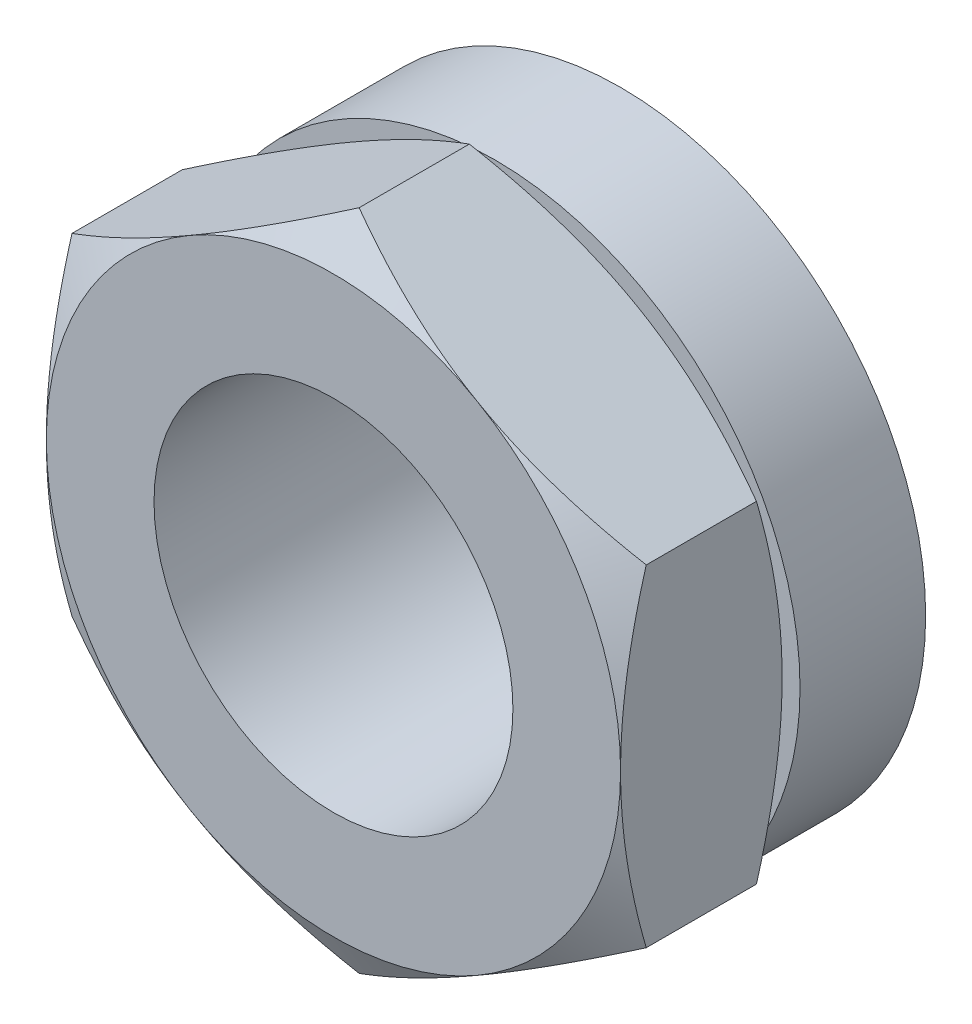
ISO-10303-21;
HEADER;
FILE_DESCRIPTION(('STEP AP214'),'2;1');
FILE_NAME('part.step','',(''),(''),'','','');
FILE_SCHEMA(('AUTOMOTIVE_DESIGN { 1 0 10303 214 1 1 1 1 }'));
ENDSEC;
DATA;
#1=APPLICATION_CONTEXT('core data for automotive mechanical design processes');
#2=APPLICATION_PROTOCOL_DEFINITION('international standard','automotive_design',2000,#1);
#3=PRODUCT_CONTEXT('',#1,'mechanical');
#4=PRODUCT('Part','Part','',(#3));
#5=PRODUCT_RELATED_PRODUCT_CATEGORY('part','',(#4));
#6=PRODUCT_DEFINITION_FORMATION('','',#4);
#7=PRODUCT_DEFINITION_CONTEXT('part definition',#1,'design');
#8=PRODUCT_DEFINITION('design','',#6,#7);
#9=PRODUCT_DEFINITION_SHAPE('','',#8);
#10=(LENGTH_UNIT() NAMED_UNIT(*) SI_UNIT(.MILLI.,.METRE.));
#11=(NAMED_UNIT(*) PLANE_ANGLE_UNIT() SI_UNIT($,.RADIAN.));
#12=(NAMED_UNIT(*) SI_UNIT($,.STERADIAN.) SOLID_ANGLE_UNIT());
#13=UNCERTAINTY_MEASURE_WITH_UNIT(LENGTH_MEASURE(1.E-05),#10,'distance_accuracy_value','');
#14=(GEOMETRIC_REPRESENTATION_CONTEXT(3) GLOBAL_UNCERTAINTY_ASSIGNED_CONTEXT((#13)) GLOBAL_UNIT_ASSIGNED_CONTEXT((#10,
#11,#12)) REPRESENTATION_CONTEXT('',''));
#15=CARTESIAN_POINT('',(0.,0.,0.));
#16=DIRECTION('',(0.,0.,1.));
#17=DIRECTION('',(1.,0.,0.));
#18=AXIS2_PLACEMENT_3D('',#15,#16,#17);
#19=CARTESIAN_POINT('',(0.,9.23760430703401,8.));
#20=DIRECTION('',(0.,0.,-1.));
#21=DIRECTION('',(-1.,0.,0.));
#22=AXIS2_PLACEMENT_3D('',#19,#20,#21);
#23=PLANE('',#22);
#24=CARTESIAN_POINT('',(0.,0.,8.));
#25=DIRECTION('',(0.,0.,1.));
#26=DIRECTION('',(1.,0.,0.));
#27=AXIS2_PLACEMENT_3D('',#24,#25,#26);
#28=CIRCLE('',#27,8.);
#29=CARTESIAN_POINT('',(-4.,6.92820323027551,8.));
#30=VERTEX_POINT('',#29);
#31=CARTESIAN_POINT('',(-8.,0.,8.));
#32=VERTEX_POINT('',#31);
#33=EDGE_CURVE('E326',#30,#32,#28,.T.);
#34=ORIENTED_EDGE('',*,*,#33,.T.);
#35=CARTESIAN_POINT('',(-4.,-6.92820323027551,8.));
#36=VERTEX_POINT('',#35);
#37=EDGE_CURVE('E327',#32,#36,#28,.T.);
#38=ORIENTED_EDGE('',*,*,#37,.T.);
#39=CARTESIAN_POINT('',(4.,-6.92820323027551,8.));
#40=VERTEX_POINT('',#39);
#41=EDGE_CURVE('E142',#36,#40,#28,.T.);
#42=ORIENTED_EDGE('',*,*,#41,.T.);
#43=CARTESIAN_POINT('',(8.,0.,8.));
#44=VERTEX_POINT('',#43);
#45=EDGE_CURVE('E140',#40,#44,#28,.T.);
#46=ORIENTED_EDGE('',*,*,#45,.T.);
#47=CARTESIAN_POINT('',(4.,6.92820323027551,8.));
#48=VERTEX_POINT('',#47);
#49=EDGE_CURVE('E144',#44,#48,#28,.T.);
#50=ORIENTED_EDGE('',*,*,#49,.T.);
#51=EDGE_CURVE('E320',#48,#30,#28,.T.);
#52=ORIENTED_EDGE('',*,*,#51,.T.);
#53=EDGE_LOOP('',(#34,#38,#42,#46,#50,#52));
#54=FACE_BOUND('',#53,.T.);
#55=CARTESIAN_POINT('',(0.,0.,8.));
#56=DIRECTION('',(0.,0.,-1.));
#57=DIRECTION('',(-1.,0.,0.));
#58=AXIS2_PLACEMENT_3D('',#55,#56,#57);
#59=CIRCLE('',#58,5.);
#60=CARTESIAN_POINT('',(-5.,0.,8.));
#61=VERTEX_POINT('',#60);
#62=EDGE_CURVE('E286',#61,#61,#59,.T.);
#63=ORIENTED_EDGE('',*,*,#62,.T.);
#64=EDGE_LOOP('',(#63));
#65=FACE_BOUND('',#64,.T.);
#66=ADVANCED_FACE('F14',(#54,#65),#23,.F.);
#67=CARTESIAN_POINT('',(-8.,4.61880215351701,3.5));
#68=DIRECTION('',(0.5,-0.866025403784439,0.));
#69=DIRECTION('',(-0.866025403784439,-0.5,0.));
#70=AXIS2_PLACEMENT_3D('',#67,#68,#69);
#71=PLANE('',#70);
#72=DIRECTION('',(0.,0.,1.));
#73=VECTOR('',#72,1.);
#74=CARTESIAN_POINT('',(0.,9.23760430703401,3.5));
#75=LINE('',#74,#73);
#76=CARTESIAN_POINT('',(0.,9.23760430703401,4.21453117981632));
#77=VERTEX_POINT('',#76);
#78=CARTESIAN_POINT('',(0.,9.23760430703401,7.28546882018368));
#79=VERTEX_POINT('',#78);
#80=EDGE_CURVE('E298',#77,#79,#75,.T.);
#81=ORIENTED_EDGE('',*,*,#80,.F.);
#82=CARTESIAN_POINT('',(0.00020000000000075,9.23771977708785,4.21459784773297));
#83=CARTESIAN_POINT('',(-0.175648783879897,9.13619343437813,4.1559907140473));
#84=CARTESIAN_POINT('',(-0.352153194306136,9.03428856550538,4.10004340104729));
#85=CARTESIAN_POINT('',(-0.706595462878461,8.82965122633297,3.99420100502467));
#86=CARTESIAN_POINT('',(-0.884533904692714,8.72691841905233,3.94430853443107));
#87=CARTESIAN_POINT('',(-1.42119823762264,8.41707512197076,3.80469279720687));
#88=CARTESIAN_POINT('',(-1.78204258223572,8.20874154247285,3.72528117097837));
#89=CARTESIAN_POINT('',(-2.32203917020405,7.89697436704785,3.63216164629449));
#90=CARTESIAN_POINT('',(-2.49957818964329,7.79447216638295,3.60563458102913));
#91=CARTESIAN_POINT('',(-2.8554591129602,7.58900421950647,3.56115317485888));
#92=CARTESIAN_POINT('',(-3.03380094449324,7.4860385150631,3.54319807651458));
#93=CARTESIAN_POINT('',(-3.39079168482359,7.27992981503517,3.51631564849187));
#94=CARTESIAN_POINT('',(-3.5694400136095,7.17678715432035,3.50737807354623));
#95=CARTESIAN_POINT('',(-3.92690170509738,6.97040655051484,3.49872230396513));
#96=CARTESIAN_POINT('',(-4.10571506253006,6.86716861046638,3.49900382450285));
#97=CARTESIAN_POINT('',(-4.4400133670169,6.67416139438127,3.50814502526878));
#98=CARTESIAN_POINT('',(-4.59552190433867,6.58437849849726,3.51588960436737));
#99=CARTESIAN_POINT('',(-4.90617476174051,6.40502298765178,3.53820113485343));
#100=CARTESIAN_POINT('',(-5.06131905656,6.31545038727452,3.55276854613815));
#101=CARTESIAN_POINT('',(-5.52615131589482,6.04707935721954,3.60636069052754));
#102=CARTESIAN_POINT('',(-5.83501648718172,5.86875596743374,3.65526864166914));
#103=CARTESIAN_POINT('',(-6.4560232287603,5.51021755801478,3.77753940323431));
#104=CARTESIAN_POINT('',(-6.76808554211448,5.33004829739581,3.851420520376));
#105=CARTESIAN_POINT('',(-7.38755648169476,4.97239658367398,4.01910014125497));
#106=CARTESIAN_POINT('',(-7.69497304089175,4.79490955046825,4.11285926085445));
#107=CARTESIAN_POINT('',(-8.0002,4.61868668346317,4.21459784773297));
#108=B_SPLINE_CURVE_WITH_KNOTS('',3,(#82,#83,#84,#85,#86,#87,#88,#89,#90,#91,#92,#93,#94,#95,
#96,#97,#98,#99,#100,#101,#102,#103,#104,#105,#106,#107),.UNSPECIFIED.,.F.,.F.,(4,2,2,2,2,2,2,2,
2,2,2,2,4),(0.,0.633973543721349,1.26821965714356,2.53934712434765,3.15934343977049,
3.77928496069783,4.39852133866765,5.01773858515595,5.55680239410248,6.09590254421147,
7.17487077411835,8.27776850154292,9.37850115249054),.UNSPECIFIED.);
#109=CARTESIAN_POINT('',(-4.,6.92820323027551,3.5));
#110=VERTEX_POINT('',#109);
#111=EDGE_CURVE('E508',#77,#110,#108,.T.);
#112=ORIENTED_EDGE('',*,*,#111,.T.);
#113=CARTESIAN_POINT('',(-8.,4.61880215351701,4.21453117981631));
#114=VERTEX_POINT('',#113);
#115=EDGE_CURVE('E185',#110,#114,#108,.T.);
#116=ORIENTED_EDGE('',*,*,#115,.T.);
#117=DIRECTION('',(0.,0.,1.));
#118=VECTOR('',#117,1.);
#119=CARTESIAN_POINT('',(-8.,4.61880215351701,3.5));
#120=LINE('',#119,#118);
#121=CARTESIAN_POINT('',(-8.,4.61880215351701,7.28546882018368));
#122=VERTEX_POINT('',#121);
#123=EDGE_CURVE('E279',#114,#122,#120,.T.);
#124=ORIENTED_EDGE('',*,*,#123,.T.);
#125=CARTESIAN_POINT('',(-8.0002,4.61868668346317,7.28540215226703));
#126=CARTESIAN_POINT('',(-7.8243512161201,4.7202130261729,7.34400928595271));
#127=CARTESIAN_POINT('',(-7.64784680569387,4.82211789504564,7.39995659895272));
#128=CARTESIAN_POINT('',(-7.29340453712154,5.02675523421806,7.50579899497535));
#129=CARTESIAN_POINT('',(-7.11546609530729,5.1294880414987,7.55569146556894));
#130=CARTESIAN_POINT('',(-6.57880176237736,5.43933133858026,7.69530720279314));
#131=CARTESIAN_POINT('',(-6.21795741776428,5.64766491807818,7.77471882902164));
#132=CARTESIAN_POINT('',(-5.67796082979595,5.95943209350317,7.86783835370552));
#133=CARTESIAN_POINT('',(-5.50042181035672,6.06193429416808,7.89436541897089));
#134=CARTESIAN_POINT('',(-5.1445408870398,6.26740224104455,7.93884682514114));
#135=CARTESIAN_POINT('',(-4.96619905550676,6.37036794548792,7.95680192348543));
#136=CARTESIAN_POINT('',(-4.60920831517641,6.57647664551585,7.98368435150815));
#137=CARTESIAN_POINT('',(-4.4305599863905,6.67961930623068,7.99262192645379));
#138=CARTESIAN_POINT('',(-4.07309829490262,6.88599991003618,8.00127769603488));
#139=CARTESIAN_POINT('',(-3.89428493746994,6.98923785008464,8.00099617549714));
#140=CARTESIAN_POINT('',(-3.5599866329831,7.18224506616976,7.99185497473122));
#141=CARTESIAN_POINT('',(-3.40447809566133,7.27202796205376,7.98411039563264));
#142=CARTESIAN_POINT('',(-3.09382523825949,7.45138347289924,7.96179886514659));
#143=CARTESIAN_POINT('',(-2.93868094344,7.54095607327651,7.94723145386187));
#144=CARTESIAN_POINT('',(-2.47384868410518,7.80932710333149,7.89363930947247));
#145=CARTESIAN_POINT('',(-2.16498351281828,7.98765049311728,7.84473135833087));
#146=CARTESIAN_POINT('',(-1.5439767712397,8.34618890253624,7.7224605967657));
#147=CARTESIAN_POINT('',(-1.23191445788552,8.52635816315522,7.64857947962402));
#148=CARTESIAN_POINT('',(-0.612443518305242,8.88400987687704,7.48089985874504));
#149=CARTESIAN_POINT('',(-0.305026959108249,9.06149691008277,7.38714073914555));
#150=CARTESIAN_POINT('',(0.000200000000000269,9.23771977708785,7.28540215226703));
#151=B_SPLINE_CURVE_WITH_KNOTS('',3,(#125,#126,#127,#128,#129,#130,#131,#132,#133,#134,#135,
#136,#137,#138,#139,#140,#141,#142,#143,#144,#145,#146,#147,#148,#149,#150),.UNSPECIFIED.,.F.,
.F.,(4,2,2,2,2,2,2,2,2,2,2,2,4),(0.,0.633973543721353,1.26821965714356,2.53934712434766,
3.15934343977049,3.77928496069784,4.39852133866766,5.01773858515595,5.55680239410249,
6.09590254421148,7.17487077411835,8.27776850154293,9.37850115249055),.UNSPECIFIED.);
#152=EDGE_CURVE('E311',#122,#30,#151,.T.);
#153=ORIENTED_EDGE('',*,*,#152,.T.);
#154=EDGE_CURVE('E234',#30,#79,#151,.T.);
#155=ORIENTED_EDGE('',*,*,#154,.T.);
#156=EDGE_LOOP('',(#81,#112,#116,#124,#153,#155));
#157=FACE_BOUND('',#156,.T.);
#158=ADVANCED_FACE('F16',(#157),#71,.F.);
#159=CARTESIAN_POINT('',(0.,9.23760430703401,3.5));
#160=DIRECTION('',(-0.5,-0.866025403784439,0.));
#161=DIRECTION('',(-0.866025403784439,0.5,0.));
#162=AXIS2_PLACEMENT_3D('',#159,#160,#161);
#163=PLANE('',#162);
#164=DIRECTION('',(0.,0.,1.));
#165=VECTOR('',#164,1.);
#166=CARTESIAN_POINT('',(8.,4.61880215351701,3.5));
#167=LINE('',#166,#165);
#168=CARTESIAN_POINT('',(8.,4.61880215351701,4.21453117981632));
#169=VERTEX_POINT('',#168);
#170=CARTESIAN_POINT('',(8.,4.61880215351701,7.28546882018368));
#171=VERTEX_POINT('',#170);
#172=EDGE_CURVE('E297',#169,#171,#167,.T.);
#173=ORIENTED_EDGE('',*,*,#172,.F.);
#174=CARTESIAN_POINT('',(8.0002,4.61868668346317,4.21459784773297));
#175=CARTESIAN_POINT('',(7.8243512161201,4.7202130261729,4.1559907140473));
#176=CARTESIAN_POINT('',(7.64784680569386,4.82211789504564,4.10004340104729));
#177=CARTESIAN_POINT('',(7.29340453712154,5.02675523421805,3.99420100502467));
#178=CARTESIAN_POINT('',(7.11546609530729,5.12948804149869,3.94430853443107));
#179=CARTESIAN_POINT('',(6.57880176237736,5.43933133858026,3.80469279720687));
#180=CARTESIAN_POINT('',(6.21795741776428,5.64766491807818,3.72528117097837));
#181=CARTESIAN_POINT('',(5.67796082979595,5.95943209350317,3.63216164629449));
#182=CARTESIAN_POINT('',(5.50042181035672,6.06193429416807,3.60563458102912));
#183=CARTESIAN_POINT('',(5.1445408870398,6.26740224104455,3.56115317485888));
#184=CARTESIAN_POINT('',(4.96619905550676,6.37036794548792,3.54319807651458));
#185=CARTESIAN_POINT('',(4.60920831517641,6.57647664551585,3.51631564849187));
#186=CARTESIAN_POINT('',(4.4305599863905,6.67961930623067,3.50737807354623));
#187=CARTESIAN_POINT('',(4.07309829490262,6.88599991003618,3.49872230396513));
#188=CARTESIAN_POINT('',(3.89428493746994,6.98923785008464,3.49900382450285));
#189=CARTESIAN_POINT('',(3.5599866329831,7.18224506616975,3.50814502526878));
#190=CARTESIAN_POINT('',(3.40447809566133,7.27202796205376,3.51588960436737));
#191=CARTESIAN_POINT('',(3.09382523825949,7.45138347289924,3.53820113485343));
#192=CARTESIAN_POINT('',(2.93868094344,7.5409560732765,3.55276854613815));
#193=CARTESIAN_POINT('',(2.47384868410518,7.80932710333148,3.60636069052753));
#194=CARTESIAN_POINT('',(2.16498351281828,7.98765049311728,3.65526864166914));
#195=CARTESIAN_POINT('',(1.5439767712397,8.34618890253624,3.77753940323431));
#196=CARTESIAN_POINT('',(1.23191445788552,8.52635816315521,3.851420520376));
#197=CARTESIAN_POINT('',(0.612443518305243,8.88400987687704,4.01910014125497));
#198=CARTESIAN_POINT('',(0.305026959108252,9.06149691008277,4.11285926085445));
#199=CARTESIAN_POINT('',(-0.000199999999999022,9.23771977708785,4.21459784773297));
#200=B_SPLINE_CURVE_WITH_KNOTS('',3,(#174,#175,#176,#177,#178,#179,#180,#181,#182,#183,#184,
#185,#186,#187,#188,#189,#190,#191,#192,#193,#194,#195,#196,#197,#198,#199),.UNSPECIFIED.,.F.,
.F.,(4,2,2,2,2,2,2,2,2,2,2,2,4),(0.,0.633973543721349,1.26821965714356,2.53934712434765,
3.15934343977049,3.77928496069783,4.39852133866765,5.01773858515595,5.55680239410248,
6.09590254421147,7.17487077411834,8.27776850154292,9.37850115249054),.UNSPECIFIED.);
#201=CARTESIAN_POINT('',(4.,6.92820323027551,3.5));
#202=VERTEX_POINT('',#201);
#203=EDGE_CURVE('E124',#169,#202,#200,.T.);
#204=ORIENTED_EDGE('',*,*,#203,.T.);
#205=EDGE_CURVE('E152',#202,#77,#200,.T.);
#206=ORIENTED_EDGE('',*,*,#205,.T.);
#207=ORIENTED_EDGE('',*,*,#80,.T.);
#208=CARTESIAN_POINT('',(-0.000199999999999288,9.23771977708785,7.28540215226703));
#209=CARTESIAN_POINT('',(0.175648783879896,9.13619343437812,7.34400928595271));
#210=CARTESIAN_POINT('',(0.352153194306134,9.03428856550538,7.39995659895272));
#211=CARTESIAN_POINT('',(0.706595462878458,8.82965122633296,7.50579899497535));
#212=CARTESIAN_POINT('',(0.88453390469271,8.72691841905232,7.55569146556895));
#213=CARTESIAN_POINT('',(1.42119823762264,8.41707512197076,7.69530720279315));
#214=CARTESIAN_POINT('',(1.78204258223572,8.20874154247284,7.77471882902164));
#215=CARTESIAN_POINT('',(2.32203917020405,7.89697436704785,7.86783835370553));
#216=CARTESIAN_POINT('',(2.49957818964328,7.79447216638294,7.89436541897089));
#217=CARTESIAN_POINT('',(2.8554591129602,7.58900421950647,7.93884682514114));
#218=CARTESIAN_POINT('',(3.03380094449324,7.4860385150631,7.95680192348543));
#219=CARTESIAN_POINT('',(3.39079168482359,7.27992981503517,7.98368435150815));
#220=CARTESIAN_POINT('',(3.5694400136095,7.17678715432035,7.99262192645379));
#221=CARTESIAN_POINT('',(3.92690170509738,6.97040655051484,8.00127769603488));
#222=CARTESIAN_POINT('',(4.10571506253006,6.86716861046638,8.00099617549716));
#223=CARTESIAN_POINT('',(4.4400133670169,6.67416139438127,7.99185497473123));
#224=CARTESIAN_POINT('',(4.59552190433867,6.58437849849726,7.98411039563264));
#225=CARTESIAN_POINT('',(4.90617476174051,6.40502298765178,7.96179886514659));
#226=CARTESIAN_POINT('',(5.06131905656,6.31545038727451,7.94723145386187));
#227=CARTESIAN_POINT('',(5.52615131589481,6.04707935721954,7.89363930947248));
#228=CARTESIAN_POINT('',(5.83501648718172,5.86875596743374,7.84473135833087));
#229=CARTESIAN_POINT('',(6.4560232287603,5.51021755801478,7.7224605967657));
#230=CARTESIAN_POINT('',(6.76808554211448,5.33004829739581,7.64857947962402));
#231=CARTESIAN_POINT('',(7.38755648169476,4.97239658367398,7.48089985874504));
#232=CARTESIAN_POINT('',(7.69497304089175,4.79490955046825,7.38714073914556));
#233=CARTESIAN_POINT('',(8.0002,4.61868668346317,7.28540215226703));
#234=B_SPLINE_CURVE_WITH_KNOTS('',3,(#208,#209,#210,#211,#212,#213,#214,#215,#216,#217,#218,
#219,#220,#221,#222,#223,#224,#225,#226,#227,#228,#229,#230,#231,#232,#233),.UNSPECIFIED.,.F.,
.F.,(4,2,2,2,2,2,2,2,2,2,2,2,4),(0.,0.633973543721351,1.26821965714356,2.53934712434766,
3.15934343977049,3.77928496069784,4.39852133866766,5.01773858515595,5.55680239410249,
6.09590254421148,7.17487077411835,8.27776850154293,9.37850115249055),.UNSPECIFIED.);
#235=EDGE_CURVE('E233',#79,#48,#234,.T.);
#236=ORIENTED_EDGE('',*,*,#235,.T.);
#237=EDGE_CURVE('E226',#48,#171,#234,.T.);
#238=ORIENTED_EDGE('',*,*,#237,.T.);
#239=EDGE_LOOP('',(#173,#204,#206,#207,#236,#238));
#240=FACE_BOUND('',#239,.T.);
#241=ADVANCED_FACE('F240',(#240),#163,.F.);
#242=CARTESIAN_POINT('',(8.,4.61880215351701,3.5));
#243=DIRECTION('',(-1.,0.,0.));
#244=DIRECTION('',(0.,1.,0.));
#245=AXIS2_PLACEMENT_3D('',#242,#243,#244);
#246=PLANE('',#245);
#247=DIRECTION('',(0.,0.,1.));
#248=VECTOR('',#247,1.);
#249=CARTESIAN_POINT('',(8.,-4.61880215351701,3.5));
#250=LINE('',#249,#248);
#251=CARTESIAN_POINT('',(8.,-4.61880215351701,4.21453117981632));
#252=VERTEX_POINT('',#251);
#253=CARTESIAN_POINT('',(8.,-4.61880215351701,7.28546882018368));
#254=VERTEX_POINT('',#253);
#255=EDGE_CURVE('E139',#252,#254,#250,.T.);
#256=ORIENTED_EDGE('',*,*,#255,.F.);
#257=CARTESIAN_POINT('',(8.,-12.3742579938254,7.38849394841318));
#258=CARTESIAN_POINT('',(8.,-12.025122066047,7.21926229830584));
#259=CARTESIAN_POINT('',(7.99999999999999,-11.6751811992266,7.05166269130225));
#260=CARTESIAN_POINT('',(7.99999999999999,-10.9732613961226,6.72064609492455));
#261=CARTESIAN_POINT('',(7.99999999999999,-10.6212821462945,6.55722977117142));
#262=CARTESIAN_POINT('',(7.99999999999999,-9.91302822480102,6.23466915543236));
#263=CARTESIAN_POINT('',(7.99999999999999,-9.55674057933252,6.0755532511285));
#264=CARTESIAN_POINT('',(7.99999999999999,-8.84132026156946,5.76387625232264));
#265=CARTESIAN_POINT('',(7.99999999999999,-8.48218772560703,5.61131484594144));
#266=CARTESIAN_POINT('',(7.99999999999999,-7.74902673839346,5.30975676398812));
#267=CARTESIAN_POINT('',(7.99999999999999,-7.37488766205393,5.16102754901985));
#268=CARTESIAN_POINT('',(7.99999999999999,-6.62222124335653,4.87490414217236));
#269=CARTESIAN_POINT('',(8.,-6.2436934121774,4.73751122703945));
#270=CARTESIAN_POINT('',(8.,-5.48236178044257,4.47769154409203));
#271=CARTESIAN_POINT('',(7.99999999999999,-5.09956853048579,4.35523419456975));
#272=CARTESIAN_POINT('',(8.,-4.32850503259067,4.12923485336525));
#273=CARTESIAN_POINT('',(8.,-3.94023656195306,4.02568686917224));
#274=CARTESIAN_POINT('',(8.,-3.16009328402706,3.8430546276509));
#275=CARTESIAN_POINT('',(8.,-2.76825020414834,3.76383851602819));
#276=CARTESIAN_POINT('',(8.,-2.17694332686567,3.66670734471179));
#277=CARTESIAN_POINT('',(8.,-1.9792358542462,3.63794445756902));
#278=CARTESIAN_POINT('',(8.,-1.58284926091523,3.58821458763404));
#279=CARTESIAN_POINT('',(8.,-1.38417023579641,3.56724685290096));
#280=CARTESIAN_POINT('',(8.,-0.98868755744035,3.53378627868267));
#281=CARTESIAN_POINT('',(8.,-0.791892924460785,3.52118723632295));
#282=CARTESIAN_POINT('',(8.,-0.397947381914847,3.50432024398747));
#283=CARTESIAN_POINT('',(8.,-0.200796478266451,3.50005215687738));
#284=CARTESIAN_POINT('',(8.,0.19350938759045,3.49994880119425));
#285=CARTESIAN_POINT('',(8.,0.390664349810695,3.50411356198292));
#286=CARTESIAN_POINT('',(8.,0.784624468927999,3.52077466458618));
#287=CARTESIAN_POINT('',(8.,0.981429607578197,3.53327142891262));
#288=CARTESIAN_POINT('',(8.,1.45541122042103,3.57313860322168));
#289=CARTESIAN_POINT('',(8.,1.73225752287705,3.6045177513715));
#290=CARTESIAN_POINT('',(8.,2.2838608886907,3.68204382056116));
#291=CARTESIAN_POINT('',(8.,2.55861765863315,3.72819277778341));
#292=CARTESIAN_POINT('',(8.,3.37945982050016,3.88634433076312));
#293=CARTESIAN_POINT('',(8.,3.92180270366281,4.01802169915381));
#294=CARTESIAN_POINT('',(8.,4.73268151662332,4.245923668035));
#295=CARTESIAN_POINT('',(8.,5.00543487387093,4.32800199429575));
#296=CARTESIAN_POINT('',(8.,5.54829180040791,4.50057561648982));
#297=CARTESIAN_POINT('',(8.,5.81839535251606,4.59107096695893));
#298=CARTESIAN_POINT('',(8.,6.35603946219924,4.77903571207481));
#299=CARTESIAN_POINT('',(8.,6.62358085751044,4.87650273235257));
#300=CARTESIAN_POINT('',(8.,7.15645457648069,5.07727484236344));
#301=CARTESIAN_POINT('',(8.,7.42178692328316,5.18057987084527));
#302=CARTESIAN_POINT('',(8.,8.03649743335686,5.42646022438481));
#303=CARTESIAN_POINT('',(8.,8.38513711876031,5.57087808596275));
#304=CARTESIAN_POINT('',(8.,9.07953862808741,5.86649352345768));
#305=CARTESIAN_POINT('',(8.,9.42530029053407,6.01769147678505));
#306=CARTESIAN_POINT('',(8.,10.1144592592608,6.32553870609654));
#307=CARTESIAN_POINT('',(8.,10.4578561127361,6.48218899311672));
#308=CARTESIAN_POINT('',(8.,11.14261799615,6.79987681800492));
#309=CARTESIAN_POINT('',(8.,11.4839829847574,6.96091444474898));
#310=CARTESIAN_POINT('',(8.,12.1653424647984,7.28673318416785));
#311=CARTESIAN_POINT('',(8.,12.5053352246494,7.45151791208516));
#312=CARTESIAN_POINT('',(8.,13.1838700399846,7.78405023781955));
#313=CARTESIAN_POINT('',(8.,13.522412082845,7.95179786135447));
#314=CARTESIAN_POINT('',(8.,14.5361173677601,8.45867202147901));
#315=CARTESIAN_POINT('',(8.,15.2094443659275,8.80147062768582));
#316=CARTESIAN_POINT('',(8.,16.498035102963,9.46591284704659));
#317=CARTESIAN_POINT('',(8.00000000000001,17.1135782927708,9.78701688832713));
#318=CARTESIAN_POINT('',(8.00000000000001,18.3423546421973,10.4336599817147));
#319=CARTESIAN_POINT('',(8.00000000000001,18.9555877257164,10.7591991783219));
#320=CARTESIAN_POINT('',(8.00000000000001,20.1787888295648,11.4128901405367));
#321=CARTESIAN_POINT('',(8.00000000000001,20.7887611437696,11.7410338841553));
#322=CARTESIAN_POINT('',(8.00000000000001,22.0072215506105,12.3999903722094));
#323=CARTESIAN_POINT('',(8.00000000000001,22.6157097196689,12.7308029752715));
#324=CARTESIAN_POINT('',(8.,23.2236482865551,13.0626157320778));
#325=B_SPLINE_CURVE_WITH_KNOTS('',3,(#257,#258,#259,#260,#261,#262,#263,#264,#265,#266,#267,
#268,#269,#270,#271,#272,#273,#274,#275,#276,#277,#278,#279,#280,#281,#282,#283,#284,#285,#286,
#287,#288,#289,#290,#291,#292,#293,#294,#295,#296,#297,#298,#299,#300,#301,#302,#303,#304,#305,
#306,#307,#308,#309,#310,#311,#312,#313,#314,#315,#316,#317,#318,#319,#320,#321,#322,#323,#324),
.UNSPECIFIED.,.F.,.F.,(4,2,2,2,2,2,2,2,2,2,2,2,2,2,2,2,2,2,2,2,2,2,2,2,2,2,2,2,2,2,2,2,2,4),(0.,
1.1639805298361,2.32814512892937,3.49870268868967,4.66920448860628,5.87691288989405,
7.0847571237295,8.29008513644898,9.49503050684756,10.6933261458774,11.292562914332,
11.891741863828,12.4831637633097,13.0745759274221,13.6659901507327,14.2574343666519,
15.0928184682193,15.9283177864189,17.6002595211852,18.4546960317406,19.3091380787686,
20.1632904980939,21.017433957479,22.1494407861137,23.2815107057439,24.4137916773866,
25.5460956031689,26.6795426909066,27.8129996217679,30.0796317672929,32.1624016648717,
34.2452395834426,36.3231403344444,38.4009317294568),.UNSPECIFIED.);
#326=CARTESIAN_POINT('',(8.,0.,3.5));
#327=VERTEX_POINT('',#326);
#328=EDGE_CURVE('E128',#252,#327,#325,.T.);
#329=ORIENTED_EDGE('',*,*,#328,.T.);
#330=EDGE_CURVE('E122',#327,#169,#325,.T.);
#331=ORIENTED_EDGE('',*,*,#330,.T.);
#332=ORIENTED_EDGE('',*,*,#172,.T.);
#333=CARTESIAN_POINT('',(8.,-12.3742579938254,4.11150605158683));
#334=CARTESIAN_POINT('',(8.,-12.025122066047,4.28073770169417));
#335=CARTESIAN_POINT('',(7.99999999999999,-11.6751811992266,4.44833730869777));
#336=CARTESIAN_POINT('',(7.99999999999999,-10.9732613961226,4.77935390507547));
#337=CARTESIAN_POINT('',(7.99999999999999,-10.6212821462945,4.9427702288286));
#338=CARTESIAN_POINT('',(7.99999999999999,-9.91302822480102,5.26533084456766));
#339=CARTESIAN_POINT('',(7.99999999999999,-9.55674057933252,5.42444674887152));
#340=CARTESIAN_POINT('',(7.99999999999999,-8.84132026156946,5.73612374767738));
#341=CARTESIAN_POINT('',(7.99999999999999,-8.48218772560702,5.88868515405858));
#342=CARTESIAN_POINT('',(7.99999999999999,-7.74902673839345,6.1902432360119));
#343=CARTESIAN_POINT('',(7.99999999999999,-7.37488766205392,6.33897245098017));
#344=CARTESIAN_POINT('',(7.99999999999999,-6.62222124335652,6.62509585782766));
#345=CARTESIAN_POINT('',(8.,-6.2436934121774,6.76248877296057));
#346=CARTESIAN_POINT('',(8.,-5.48236178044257,7.02230845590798));
#347=CARTESIAN_POINT('',(7.99999999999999,-5.09956853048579,7.14476580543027));
#348=CARTESIAN_POINT('',(8.,-4.32850503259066,7.37076514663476));
#349=CARTESIAN_POINT('',(8.,-3.94023656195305,7.47431313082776));
#350=CARTESIAN_POINT('',(8.,-3.16009328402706,7.65694537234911));
#351=CARTESIAN_POINT('',(8.,-2.76825020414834,7.73616148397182));
#352=CARTESIAN_POINT('',(8.,-2.17694332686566,7.83329265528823));
#353=CARTESIAN_POINT('',(8.,-1.9792358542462,7.86205554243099));
#354=CARTESIAN_POINT('',(8.,-1.58284926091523,7.91178541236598));
#355=CARTESIAN_POINT('',(8.,-1.38417023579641,7.93275314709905));
#356=CARTESIAN_POINT('',(8.,-0.98868755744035,7.96621372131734));
#357=CARTESIAN_POINT('',(8.,-0.791892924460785,7.97881276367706));
#358=CARTESIAN_POINT('',(8.,-0.397947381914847,7.99567975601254));
#359=CARTESIAN_POINT('',(8.,-0.200796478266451,7.99994784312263));
#360=CARTESIAN_POINT('',(8.,0.19350938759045,8.00005119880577));
#361=CARTESIAN_POINT('',(8.,0.390664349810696,7.9958864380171));
#362=CARTESIAN_POINT('',(8.,0.784624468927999,7.97922533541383));
#363=CARTESIAN_POINT('',(8.,0.981429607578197,7.96672857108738));
#364=CARTESIAN_POINT('',(8.,1.45541122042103,7.92686139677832));
#365=CARTESIAN_POINT('',(8.,1.73225752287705,7.89548224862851));
#366=CARTESIAN_POINT('',(8.,2.2838608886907,7.81795617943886));
#367=CARTESIAN_POINT('',(8.,2.55861765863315,7.7718072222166));
#368=CARTESIAN_POINT('',(8.,3.37945982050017,7.61365566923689));
#369=CARTESIAN_POINT('',(8.,3.92180270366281,7.48197830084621));
#370=CARTESIAN_POINT('',(8.,4.73268151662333,7.25407633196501));
#371=CARTESIAN_POINT('',(8.,5.00543487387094,7.17199800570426));
#372=CARTESIAN_POINT('',(8.,5.54829180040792,6.9994243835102));
#373=CARTESIAN_POINT('',(8.,5.81839535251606,6.90892903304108));
#374=CARTESIAN_POINT('',(8.,6.35603946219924,6.7209642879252));
#375=CARTESIAN_POINT('',(8.,6.62358085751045,6.62349726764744));
#376=CARTESIAN_POINT('',(8.,7.1564545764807,6.42272515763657));
#377=CARTESIAN_POINT('',(8.,7.42178692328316,6.31942012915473));
#378=CARTESIAN_POINT('',(8.,8.03649743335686,6.07353977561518));
#379=CARTESIAN_POINT('',(8.,8.38513711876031,5.92912191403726));
#380=CARTESIAN_POINT('',(8.,9.07953862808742,5.63350647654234));
#381=CARTESIAN_POINT('',(8.,9.42530029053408,5.48230852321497));
#382=CARTESIAN_POINT('',(8.,10.1144592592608,5.17446129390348));
#383=CARTESIAN_POINT('',(8.,10.4578561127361,5.01781100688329));
#384=CARTESIAN_POINT('',(8.,11.14261799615,4.7001231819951));
#385=CARTESIAN_POINT('',(8.,11.4839829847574,4.53908555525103));
#386=CARTESIAN_POINT('',(8.,12.1653424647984,4.21326681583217));
#387=CARTESIAN_POINT('',(8.,12.5053352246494,4.04848208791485));
#388=CARTESIAN_POINT('',(8.,13.1838700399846,3.71594976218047));
#389=CARTESIAN_POINT('',(8.,13.522412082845,3.54820213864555));
#390=CARTESIAN_POINT('',(8.,14.5361173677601,3.04132797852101));
#391=CARTESIAN_POINT('',(8.,15.2094443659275,2.6985293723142));
#392=CARTESIAN_POINT('',(8.,16.498035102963,2.03408715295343));
#393=CARTESIAN_POINT('',(8.00000000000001,17.1135782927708,1.71298311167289));
#394=CARTESIAN_POINT('',(8.00000000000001,18.3423546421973,1.06634001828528));
#395=CARTESIAN_POINT('',(8.00000000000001,18.9555877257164,0.740800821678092));
#396=CARTESIAN_POINT('',(8.00000000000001,20.1787888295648,0.0871098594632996));
#397=CARTESIAN_POINT('',(8.00000000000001,20.7887611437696,-0.241033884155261));
#398=CARTESIAN_POINT('',(8.00000000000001,22.0072215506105,-0.899990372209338));
#399=CARTESIAN_POINT('',(8.00000000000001,22.6157097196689,-1.23080297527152));
#400=CARTESIAN_POINT('',(8.,23.2236482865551,-1.56261573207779));
#401=B_SPLINE_CURVE_WITH_KNOTS('',3,(#333,#334,#335,#336,#337,#338,#339,#340,#341,#342,#343,
#344,#345,#346,#347,#348,#349,#350,#351,#352,#353,#354,#355,#356,#357,#358,#359,#360,#361,#362,
#363,#364,#365,#366,#367,#368,#369,#370,#371,#372,#373,#374,#375,#376,#377,#378,#379,#380,#381,
#382,#383,#384,#385,#386,#387,#388,#389,#390,#391,#392,#393,#394,#395,#396,#397,#398,#399,#400),
.UNSPECIFIED.,.F.,.F.,(4,2,2,2,2,2,2,2,2,2,2,2,2,2,2,2,2,2,2,2,2,2,2,2,2,2,2,2,2,2,2,2,2,4),(0.,
1.1639805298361,2.32814512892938,3.49870268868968,4.66920448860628,5.87691288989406,
7.0847571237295,8.29008513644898,9.49503050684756,10.6933261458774,11.292562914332,
11.891741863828,12.4831637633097,13.0745759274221,13.6659901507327,14.2574343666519,
15.0928184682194,15.9283177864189,17.6002595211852,18.4546960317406,19.3091380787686,
20.1632904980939,21.017433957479,22.1494407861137,23.2815107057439,24.4137916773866,
25.5460956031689,26.6795426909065,27.8129996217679,30.0796317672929,32.1624016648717,
34.2452395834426,36.3231403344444,38.4009317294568),.UNSPECIFIED.);
#402=EDGE_CURVE('E225',#171,#44,#401,.F.);
#403=ORIENTED_EDGE('',*,*,#402,.T.);
#404=EDGE_CURVE('E219',#44,#254,#401,.F.);
#405=ORIENTED_EDGE('',*,*,#404,.T.);
#406=EDGE_LOOP('',(#256,#329,#331,#332,#403,#405));
#407=FACE_BOUND('',#406,.T.);
#408=ADVANCED_FACE('F137',(#407),#246,.F.);
#409=CARTESIAN_POINT('',(8.,-4.61880215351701,3.5));
#410=DIRECTION('',(-0.5,0.866025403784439,0.));
#411=DIRECTION('',(0.866025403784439,0.5,0.));
#412=AXIS2_PLACEMENT_3D('',#409,#410,#411);
#413=PLANE('',#412);
#414=DIRECTION('',(0.,0.,1.));
#415=VECTOR('',#414,1.);
#416=CARTESIAN_POINT('',(0.,-9.23760430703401,3.5));
#417=LINE('',#416,#415);
#418=CARTESIAN_POINT('',(0.,-9.23760430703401,4.21453117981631));
#419=VERTEX_POINT('',#418);
#420=CARTESIAN_POINT('',(0.,-9.23760430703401,7.28546882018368));
#421=VERTEX_POINT('',#420);
#422=EDGE_CURVE('E288',#419,#421,#417,.T.);
#423=ORIENTED_EDGE('',*,*,#422,.F.);
#424=CARTESIAN_POINT('',(-0.000200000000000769,-9.23771977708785,4.21459784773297));
#425=CARTESIAN_POINT('',(0.175648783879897,-9.13619343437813,4.1559907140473));
#426=CARTESIAN_POINT('',(0.352153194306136,-9.03428856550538,4.10004340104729));
#427=CARTESIAN_POINT('',(0.706595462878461,-8.82965122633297,3.99420100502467));
#428=CARTESIAN_POINT('',(0.884533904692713,-8.72691841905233,3.94430853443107));
#429=CARTESIAN_POINT('',(1.42119823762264,-8.41707512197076,3.80469279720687));
#430=CARTESIAN_POINT('',(1.78204258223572,-8.20874154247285,3.72528117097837));
#431=CARTESIAN_POINT('',(2.32203917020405,-7.89697436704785,3.63216164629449));
#432=CARTESIAN_POINT('',(2.49957818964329,-7.79447216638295,3.60563458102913));
#433=CARTESIAN_POINT('',(2.8554591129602,-7.58900421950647,3.56115317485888));
#434=CARTESIAN_POINT('',(3.03380094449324,-7.4860385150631,3.54319807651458));
#435=CARTESIAN_POINT('',(3.39079168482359,-7.27992981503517,3.51631564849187));
#436=CARTESIAN_POINT('',(3.5694400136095,-7.17678715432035,3.50737807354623));
#437=CARTESIAN_POINT('',(3.92690170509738,-6.97040655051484,3.49872230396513));
#438=CARTESIAN_POINT('',(4.10571506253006,-6.86716861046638,3.49900382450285));
#439=CARTESIAN_POINT('',(4.4400133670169,-6.67416139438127,3.50814502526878));
#440=CARTESIAN_POINT('',(4.59552190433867,-6.58437849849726,3.51588960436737));
#441=CARTESIAN_POINT('',(4.90617476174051,-6.40502298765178,3.53820113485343));
#442=CARTESIAN_POINT('',(5.06131905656,-6.31545038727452,3.55276854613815));
#443=CARTESIAN_POINT('',(5.52615131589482,-6.04707935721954,3.60636069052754));
#444=CARTESIAN_POINT('',(5.83501648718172,-5.86875596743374,3.65526864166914));
#445=CARTESIAN_POINT('',(6.4560232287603,-5.51021755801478,3.77753940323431));
#446=CARTESIAN_POINT('',(6.76808554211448,-5.33004829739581,3.851420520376));
#447=CARTESIAN_POINT('',(7.38755648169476,-4.97239658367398,4.01910014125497));
#448=CARTESIAN_POINT('',(7.69497304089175,-4.79490955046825,4.11285926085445));
#449=CARTESIAN_POINT('',(8.0002,-4.61868668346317,4.21459784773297));
#450=B_SPLINE_CURVE_WITH_KNOTS('',3,(#424,#425,#426,#427,#428,#429,#430,#431,#432,#433,#434,
#435,#436,#437,#438,#439,#440,#441,#442,#443,#444,#445,#446,#447,#448,#449),.UNSPECIFIED.,.F.,
.F.,(4,2,2,2,2,2,2,2,2,2,2,2,4),(0.,0.633973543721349,1.26821965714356,2.53934712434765,
3.15934343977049,3.77928496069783,4.39852133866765,5.01773858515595,5.55680239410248,
6.09590254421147,7.17487077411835,8.27776850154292,9.37850115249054),.UNSPECIFIED.);
#451=CARTESIAN_POINT('',(4.,-6.92820323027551,3.5));
#452=VERTEX_POINT('',#451);
#453=EDGE_CURVE('E190',#419,#452,#450,.T.);
#454=ORIENTED_EDGE('',*,*,#453,.T.);
#455=EDGE_CURVE('E129',#452,#252,#450,.T.);
#456=ORIENTED_EDGE('',*,*,#455,.T.);
#457=ORIENTED_EDGE('',*,*,#255,.T.);
#458=CARTESIAN_POINT('',(8.0002,-4.61868668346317,7.28540215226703));
#459=CARTESIAN_POINT('',(7.8243512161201,-4.7202130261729,7.34400928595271));
#460=CARTESIAN_POINT('',(7.64784680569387,-4.82211789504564,7.39995659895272));
#461=CARTESIAN_POINT('',(7.29340453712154,-5.02675523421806,7.50579899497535));
#462=CARTESIAN_POINT('',(7.11546609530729,-5.1294880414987,7.55569146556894));
#463=CARTESIAN_POINT('',(6.57880176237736,-5.43933133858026,7.69530720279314));
#464=CARTESIAN_POINT('',(6.21795741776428,-5.64766491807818,7.77471882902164));
#465=CARTESIAN_POINT('',(5.67796082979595,-5.95943209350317,7.86783835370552));
#466=CARTESIAN_POINT('',(5.50042181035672,-6.06193429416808,7.89436541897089));
#467=CARTESIAN_POINT('',(5.1445408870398,-6.26740224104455,7.93884682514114));
#468=CARTESIAN_POINT('',(4.96619905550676,-6.37036794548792,7.95680192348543));
#469=CARTESIAN_POINT('',(4.60920831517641,-6.57647664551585,7.98368435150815));
#470=CARTESIAN_POINT('',(4.4305599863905,-6.67961930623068,7.99262192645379));
#471=CARTESIAN_POINT('',(4.07309829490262,-6.88599991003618,8.00127769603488));
#472=CARTESIAN_POINT('',(3.89428493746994,-6.98923785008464,8.00099617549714));
#473=CARTESIAN_POINT('',(3.5599866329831,-7.18224506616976,7.99185497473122));
#474=CARTESIAN_POINT('',(3.40447809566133,-7.27202796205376,7.98411039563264));
#475=CARTESIAN_POINT('',(3.09382523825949,-7.45138347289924,7.96179886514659));
#476=CARTESIAN_POINT('',(2.93868094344,-7.54095607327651,7.94723145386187));
#477=CARTESIAN_POINT('',(2.47384868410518,-7.80932710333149,7.89363930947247));
#478=CARTESIAN_POINT('',(2.16498351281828,-7.98765049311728,7.84473135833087));
#479=CARTESIAN_POINT('',(1.5439767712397,-8.34618890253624,7.7224605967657));
#480=CARTESIAN_POINT('',(1.23191445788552,-8.52635816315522,7.64857947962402));
#481=CARTESIAN_POINT('',(0.612443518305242,-8.88400987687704,7.48089985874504));
#482=CARTESIAN_POINT('',(0.305026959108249,-9.06149691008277,7.38714073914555));
#483=CARTESIAN_POINT('',(-0.000200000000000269,-9.23771977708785,7.28540215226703));
#484=B_SPLINE_CURVE_WITH_KNOTS('',3,(#458,#459,#460,#461,#462,#463,#464,#465,#466,#467,#468,
#469,#470,#471,#472,#473,#474,#475,#476,#477,#478,#479,#480,#481,#482,#483),.UNSPECIFIED.,.F.,
.F.,(4,2,2,2,2,2,2,2,2,2,2,2,4),(0.,0.633973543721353,1.26821965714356,2.53934712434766,
3.15934343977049,3.77928496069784,4.39852133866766,5.01773858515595,5.55680239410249,
6.09590254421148,7.17487077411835,8.27776850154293,9.37850115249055),.UNSPECIFIED.);
#485=EDGE_CURVE('E212',#254,#40,#484,.T.);
#486=ORIENTED_EDGE('',*,*,#485,.T.);
#487=EDGE_CURVE('E205',#40,#421,#484,.T.);
#488=ORIENTED_EDGE('',*,*,#487,.T.);
#489=EDGE_LOOP('',(#423,#454,#456,#457,#486,#488));
#490=FACE_BOUND('',#489,.T.);
#491=ADVANCED_FACE('F197',(#490),#413,.F.);
#492=CARTESIAN_POINT('',(0.,-9.23760430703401,3.5));
#493=DIRECTION('',(0.5,0.866025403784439,0.));
#494=DIRECTION('',(0.866025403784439,-0.5,0.));
#495=AXIS2_PLACEMENT_3D('',#492,#493,#494);
#496=PLANE('',#495);
#497=DIRECTION('',(0.,0.,1.));
#498=VECTOR('',#497,1.);
#499=CARTESIAN_POINT('',(-8.,-4.61880215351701,3.5));
#500=LINE('',#499,#498);
#501=CARTESIAN_POINT('',(-8.,-4.61880215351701,4.21453117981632));
#502=VERTEX_POINT('',#501);
#503=CARTESIAN_POINT('',(-8.,-4.61880215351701,7.28546882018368));
#504=VERTEX_POINT('',#503);
#505=EDGE_CURVE('E285',#502,#504,#500,.T.);
#506=ORIENTED_EDGE('',*,*,#505,.F.);
#507=CARTESIAN_POINT('',(-8.0002,-4.61868668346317,4.21459784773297));
#508=CARTESIAN_POINT('',(-7.8243512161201,-4.7202130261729,4.1559907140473));
#509=CARTESIAN_POINT('',(-7.64784680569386,-4.82211789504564,4.10004340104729));
#510=CARTESIAN_POINT('',(-7.29340453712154,-5.02675523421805,3.99420100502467));
#511=CARTESIAN_POINT('',(-7.11546609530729,-5.12948804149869,3.94430853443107));
#512=CARTESIAN_POINT('',(-6.57880176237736,-5.43933133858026,3.80469279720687));
#513=CARTESIAN_POINT('',(-6.21795741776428,-5.64766491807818,3.72528117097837));
#514=CARTESIAN_POINT('',(-5.67796082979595,-5.95943209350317,3.63216164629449));
#515=CARTESIAN_POINT('',(-5.50042181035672,-6.06193429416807,3.60563458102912));
#516=CARTESIAN_POINT('',(-5.1445408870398,-6.26740224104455,3.56115317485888));
#517=CARTESIAN_POINT('',(-4.96619905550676,-6.37036794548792,3.54319807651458));
#518=CARTESIAN_POINT('',(-4.60920831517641,-6.57647664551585,3.51631564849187));
#519=CARTESIAN_POINT('',(-4.4305599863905,-6.67961930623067,3.50737807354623));
#520=CARTESIAN_POINT('',(-4.07309829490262,-6.88599991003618,3.49872230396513));
#521=CARTESIAN_POINT('',(-3.89428493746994,-6.98923785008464,3.49900382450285));
#522=CARTESIAN_POINT('',(-3.5599866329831,-7.18224506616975,3.50814502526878));
#523=CARTESIAN_POINT('',(-3.40447809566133,-7.27202796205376,3.51588960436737));
#524=CARTESIAN_POINT('',(-3.09382523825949,-7.45138347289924,3.53820113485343));
#525=CARTESIAN_POINT('',(-2.93868094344,-7.5409560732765,3.55276854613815));
#526=CARTESIAN_POINT('',(-2.47384868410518,-7.80932710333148,3.60636069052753));
#527=CARTESIAN_POINT('',(-2.16498351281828,-7.98765049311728,3.65526864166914));
#528=CARTESIAN_POINT('',(-1.5439767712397,-8.34618890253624,3.77753940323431));
#529=CARTESIAN_POINT('',(-1.23191445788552,-8.52635816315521,3.851420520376));
#530=CARTESIAN_POINT('',(-0.612443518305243,-8.88400987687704,4.01910014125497));
#531=CARTESIAN_POINT('',(-0.305026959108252,-9.06149691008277,4.11285926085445));
#532=CARTESIAN_POINT('',(0.000199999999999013,-9.23771977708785,4.21459784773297));
#533=B_SPLINE_CURVE_WITH_KNOTS('',3,(#507,#508,#509,#510,#511,#512,#513,#514,#515,#516,#517,
#518,#519,#520,#521,#522,#523,#524,#525,#526,#527,#528,#529,#530,#531,#532),.UNSPECIFIED.,.F.,
.F.,(4,2,2,2,2,2,2,2,2,2,2,2,4),(0.,0.633973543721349,1.26821965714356,2.53934712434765,
3.15934343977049,3.77928496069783,4.39852133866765,5.01773858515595,5.55680239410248,
6.09590254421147,7.17487077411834,8.27776850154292,9.37850115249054),.UNSPECIFIED.);
#534=CARTESIAN_POINT('',(-4.,-6.92820323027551,3.5));
#535=VERTEX_POINT('',#534);
#536=EDGE_CURVE('E42',#502,#535,#533,.T.);
#537=ORIENTED_EDGE('',*,*,#536,.T.);
#538=EDGE_CURVE('E196',#535,#419,#533,.T.);
#539=ORIENTED_EDGE('',*,*,#538,.T.);
#540=ORIENTED_EDGE('',*,*,#422,.T.);
#541=CARTESIAN_POINT('',(0.00019999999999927,-9.23771977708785,7.28540215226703));
#542=CARTESIAN_POINT('',(-0.175648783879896,-9.13619343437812,7.34400928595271));
#543=CARTESIAN_POINT('',(-0.352153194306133,-9.03428856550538,7.39995659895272));
#544=CARTESIAN_POINT('',(-0.706595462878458,-8.82965122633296,7.50579899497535));
#545=CARTESIAN_POINT('',(-0.88453390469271,-8.72691841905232,7.55569146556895));
#546=CARTESIAN_POINT('',(-1.42119823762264,-8.41707512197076,7.69530720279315));
#547=CARTESIAN_POINT('',(-1.78204258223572,-8.20874154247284,7.77471882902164));
#548=CARTESIAN_POINT('',(-2.32203917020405,-7.89697436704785,7.86783835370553));
#549=CARTESIAN_POINT('',(-2.49957818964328,-7.79447216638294,7.89436541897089));
#550=CARTESIAN_POINT('',(-2.8554591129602,-7.58900421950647,7.93884682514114));
#551=CARTESIAN_POINT('',(-3.03380094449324,-7.4860385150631,7.95680192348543));
#552=CARTESIAN_POINT('',(-3.39079168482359,-7.27992981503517,7.98368435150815));
#553=CARTESIAN_POINT('',(-3.5694400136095,-7.17678715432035,7.99262192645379));
#554=CARTESIAN_POINT('',(-3.92690170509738,-6.97040655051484,8.00127769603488));
#555=CARTESIAN_POINT('',(-4.10571506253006,-6.86716861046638,8.00099617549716));
#556=CARTESIAN_POINT('',(-4.4400133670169,-6.67416139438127,7.99185497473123));
#557=CARTESIAN_POINT('',(-4.59552190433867,-6.58437849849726,7.98411039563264));
#558=CARTESIAN_POINT('',(-4.90617476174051,-6.40502298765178,7.96179886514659));
#559=CARTESIAN_POINT('',(-5.06131905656,-6.31545038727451,7.94723145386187));
#560=CARTESIAN_POINT('',(-5.52615131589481,-6.04707935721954,7.89363930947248));
#561=CARTESIAN_POINT('',(-5.83501648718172,-5.86875596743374,7.84473135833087));
#562=CARTESIAN_POINT('',(-6.4560232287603,-5.51021755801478,7.7224605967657));
#563=CARTESIAN_POINT('',(-6.76808554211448,-5.33004829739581,7.64857947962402));
#564=CARTESIAN_POINT('',(-7.38755648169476,-4.97239658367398,7.48089985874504));
#565=CARTESIAN_POINT('',(-7.69497304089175,-4.79490955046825,7.38714073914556));
#566=CARTESIAN_POINT('',(-8.0002,-4.61868668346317,7.28540215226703));
#567=B_SPLINE_CURVE_WITH_KNOTS('',3,(#541,#542,#543,#544,#545,#546,#547,#548,#549,#550,#551,
#552,#553,#554,#555,#556,#557,#558,#559,#560,#561,#562,#563,#564,#565,#566),.UNSPECIFIED.,.F.,
.F.,(4,2,2,2,2,2,2,2,2,2,2,2,4),(0.,0.633973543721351,1.26821965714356,2.53934712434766,
3.15934343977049,3.77928496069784,4.39852133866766,5.01773858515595,5.55680239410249,
6.09590254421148,7.17487077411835,8.27776850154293,9.37850115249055),.UNSPECIFIED.);
#568=EDGE_CURVE('E213',#421,#36,#567,.T.);
#569=ORIENTED_EDGE('',*,*,#568,.T.);
#570=EDGE_CURVE('E214',#36,#504,#567,.T.);
#571=ORIENTED_EDGE('',*,*,#570,.T.);
#572=EDGE_LOOP('',(#506,#537,#539,#540,#569,#571));
#573=FACE_BOUND('',#572,.T.);
#574=ADVANCED_FACE('F200',(#573),#496,.F.);
#575=CARTESIAN_POINT('',(-8.,-4.61880215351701,3.5));
#576=DIRECTION('',(1.,0.,0.));
#577=DIRECTION('',(0.,-1.,0.));
#578=AXIS2_PLACEMENT_3D('',#575,#576,#577);
#579=PLANE('',#578);
#580=ORIENTED_EDGE('',*,*,#123,.F.);
#581=CARTESIAN_POINT('',(-8.,-12.3742579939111,7.38849394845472));
#582=CARTESIAN_POINT('',(-8.,-12.0251220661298,7.21926229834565));
#583=CARTESIAN_POINT('',(-8.,-11.6751811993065,7.05166269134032));
#584=CARTESIAN_POINT('',(-8.,-10.9732613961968,6.72064609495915));
#585=CARTESIAN_POINT('',(-8.,-10.6212821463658,6.55722977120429));
#586=CARTESIAN_POINT('',(-8.,-9.91302822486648,6.23466915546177));
#587=CARTESIAN_POINT('',(-8.,-9.55674057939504,6.07555325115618));
#588=CARTESIAN_POINT('',(-8.,-8.84132026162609,5.76387625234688));
#589=CARTESIAN_POINT('',(-8.,-8.4821877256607,5.61131484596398));
#590=CARTESIAN_POINT('',(-8.,-7.749026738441,5.30975676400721));
#591=CARTESIAN_POINT('',(-8.,-7.3748876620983,5.16102754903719));
#592=CARTESIAN_POINT('',(-8.,-6.6222212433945,4.87490414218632));
#593=CARTESIAN_POINT('',(-8.,-6.24369341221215,4.73751122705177));
#594=CARTESIAN_POINT('',(-8.,-5.48236178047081,4.47769154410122));
#595=CARTESIAN_POINT('',(-8.,-5.09956853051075,4.35523419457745));
#596=CARTESIAN_POINT('',(-8.,-4.32850503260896,4.12923485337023));
#597=CARTESIAN_POINT('',(-8.,-3.94023656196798,4.02568686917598));
#598=CARTESIAN_POINT('',(-8.,-3.16009328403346,3.84305462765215));
#599=CARTESIAN_POINT('',(-8.,-2.76825020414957,3.76383851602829));
#600=CARTESIAN_POINT('',(-8.,-2.17694332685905,3.66670734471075));
#601=CARTESIAN_POINT('',(-8.,-1.97923585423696,3.63794445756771));
#602=CARTESIAN_POINT('',(-8.,-1.58284926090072,3.58821458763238));
#603=CARTESIAN_POINT('',(-8.,-1.38417023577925,3.56724685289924));
#604=CARTESIAN_POINT('',(-8.,-0.988687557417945,3.53378627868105));
#605=CARTESIAN_POINT('',(-8.,-0.791892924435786,3.52118723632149));
#606=CARTESIAN_POINT('',(-8.,-0.397947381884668,3.50432024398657));
#607=CARTESIAN_POINT('',(-8.,-0.200796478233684,3.50005215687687));
#608=CARTESIAN_POINT('',(-8.,0.193509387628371,3.49994880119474));
#609=CARTESIAN_POINT('',(-8.,0.390664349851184,3.50411356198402));
#610=CARTESIAN_POINT('',(-8.,0.784624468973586,3.52077466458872));
#611=CARTESIAN_POINT('',(-8.,0.981429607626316,3.53327142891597));
#612=CARTESIAN_POINT('',(-8.,1.45541122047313,3.57313860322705));
#613=CARTESIAN_POINT('',(-8.,1.73225752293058,3.60451775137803));
#614=CARTESIAN_POINT('',(-8.,2.28386088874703,3.68204382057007));
#615=CARTESIAN_POINT('',(-8.,2.55861765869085,3.72819277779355));
#616=CARTESIAN_POINT('',(-8.,3.3794598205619,3.88634433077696));
#617=CARTESIAN_POINT('',(-8.,3.92180270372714,4.01802169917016));
#618=CARTESIAN_POINT('',(-8.,4.73268151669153,4.24592366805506));
#619=CARTESIAN_POINT('',(-8.,5.00543487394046,4.32800199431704));
#620=CARTESIAN_POINT('',(-8.,5.54829180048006,4.50057561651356));
#621=CARTESIAN_POINT('',(-8.,5.8183953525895,4.59107096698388));
#622=CARTESIAN_POINT('',(-8.,6.35603946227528,4.77903571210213));
#623=CARTESIAN_POINT('',(-7.99999999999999,6.62358085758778,4.87650273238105));
#624=CARTESIAN_POINT('',(-8.,7.15645457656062,5.07727484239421));
#625=CARTESIAN_POINT('',(-8.,7.42178692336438,5.18057987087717));
#626=CARTESIAN_POINT('',(-8.,8.036497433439,5.42646022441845));
#627=CARTESIAN_POINT('',(-8.,8.38513711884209,5.57087808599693));
#628=CARTESIAN_POINT('',(-7.99999999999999,9.07953862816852,5.86649352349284));
#629=CARTESIAN_POINT('',(-7.99999999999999,9.42530029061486,6.01769147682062));
#630=CARTESIAN_POINT('',(-7.99999999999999,10.114459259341,6.32553870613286));
#631=CARTESIAN_POINT('',(-7.99999999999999,10.457856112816,6.48218899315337));
#632=CARTESIAN_POINT('',(-7.99999999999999,11.1426179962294,6.79987681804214));
#633=CARTESIAN_POINT('',(-7.99999999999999,11.4839829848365,6.96091444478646));
#634=CARTESIAN_POINT('',(-7.99999999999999,12.165342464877,7.28673318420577));
#635=CARTESIAN_POINT('',(-7.99999999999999,12.5053352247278,7.45151791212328));
#636=CARTESIAN_POINT('',(-7.99999999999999,13.1838700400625,7.784050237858));
#637=CARTESIAN_POINT('',(-7.99999999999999,13.5224120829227,7.95179786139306));
#638=CARTESIAN_POINT('',(-7.99999999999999,14.5361173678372,8.45867202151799));
#639=CARTESIAN_POINT('',(-7.99999999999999,15.2094443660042,8.80147062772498));
#640=CARTESIAN_POINT('',(-7.99999999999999,16.4980351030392,9.46591284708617));
#641=CARTESIAN_POINT('',(-7.99999999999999,17.1135782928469,9.78701688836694));
#642=CARTESIAN_POINT('',(-7.99999999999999,18.3423546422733,10.433659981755));
#643=CARTESIAN_POINT('',(-7.99999999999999,18.9555877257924,10.7591991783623));
#644=CARTESIAN_POINT('',(-7.99999999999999,20.1787888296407,11.4128901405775));
#645=CARTESIAN_POINT('',(-7.99999999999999,20.7887611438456,11.7410338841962));
#646=CARTESIAN_POINT('',(-7.99999999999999,22.0072215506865,12.3999903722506));
#647=CARTESIAN_POINT('',(-7.99999999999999,22.6157097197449,12.7308029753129));
#648=CARTESIAN_POINT('',(-8.,23.2236482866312,13.0626157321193));
#649=B_SPLINE_CURVE_WITH_KNOTS('',3,(#581,#582,#583,#584,#585,#586,#587,#588,#589,#590,#591,
#592,#593,#594,#595,#596,#597,#598,#599,#600,#601,#602,#603,#604,#605,#606,#607,#608,#609,#610,
#611,#612,#613,#614,#615,#616,#617,#618,#619,#620,#621,#622,#623,#624,#625,#626,#627,#628,#629,
#630,#631,#632,#633,#634,#635,#636,#637,#638,#639,#640,#641,#642,#643,#644,#645,#646,#647,#648),
.UNSPECIFIED.,.F.,.F.,(4,2,2,2,2,2,2,2,2,2,2,2,2,2,2,2,2,2,2,2,2,2,2,2,2,2,2,2,2,2,2,2,2,4),(0.,
1.16398052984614,2.32814512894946,3.49870268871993,4.66920448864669,5.87691288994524,
7.08475712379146,8.29008513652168,9.49503050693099,10.6933261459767,11.2925629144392,
11.8917418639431,12.4831637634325,13.0745759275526,13.665990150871,14.2574343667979,
15.09281846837,15.9283177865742,17.6002595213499,18.4546960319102,19.309138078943,
20.1632904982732,21.017433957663,22.1494407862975,23.2815107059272,24.4137916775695,
25.5460956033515,26.6795426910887,27.8129996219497,30.0796317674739,32.1624016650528,
34.2452395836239,36.3231403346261,38.4009317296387),.UNSPECIFIED.);
#650=CARTESIAN_POINT('',(-8.,0.,3.5));
#651=VERTEX_POINT('',#650);
#652=EDGE_CURVE('E280',#114,#651,#649,.F.);
#653=ORIENTED_EDGE('',*,*,#652,.T.);
#654=EDGE_CURVE('E119',#651,#502,#649,.F.);
#655=ORIENTED_EDGE('',*,*,#654,.T.);
#656=ORIENTED_EDGE('',*,*,#505,.T.);
#657=CARTESIAN_POINT('',(-8.,-12.3742579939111,4.11150605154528));
#658=CARTESIAN_POINT('',(-8.,-12.0251220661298,4.28073770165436));
#659=CARTESIAN_POINT('',(-8.,-11.6751811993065,4.44833730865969));
#660=CARTESIAN_POINT('',(-8.,-10.9732613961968,4.77935390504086));
#661=CARTESIAN_POINT('',(-8.,-10.6212821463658,4.94277022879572));
#662=CARTESIAN_POINT('',(-8.,-9.91302822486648,5.26533084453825));
#663=CARTESIAN_POINT('',(-8.,-9.55674057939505,5.42444674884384));
#664=CARTESIAN_POINT('',(-8.,-8.8413202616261,5.73612374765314));
#665=CARTESIAN_POINT('',(-8.,-8.48218772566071,5.88868515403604));
#666=CARTESIAN_POINT('',(-8.,-7.74902673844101,6.19024323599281));
#667=CARTESIAN_POINT('',(-8.,-7.37488766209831,6.33897245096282));
#668=CARTESIAN_POINT('',(-8.,-6.62222124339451,6.62509585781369));
#669=CARTESIAN_POINT('',(-8.,-6.24369341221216,6.76248877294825));
#670=CARTESIAN_POINT('',(-8.,-5.48236178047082,7.0223084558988));
#671=CARTESIAN_POINT('',(-8.,-5.09956853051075,7.14476580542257));
#672=CARTESIAN_POINT('',(-8.,-4.32850503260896,7.37076514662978));
#673=CARTESIAN_POINT('',(-8.,-3.94023656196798,7.47431313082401));
#674=CARTESIAN_POINT('',(-8.,-3.16009328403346,7.65694537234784));
#675=CARTESIAN_POINT('',(-8.,-2.76825020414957,7.73616148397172));
#676=CARTESIAN_POINT('',(-8.,-2.17694332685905,7.83329265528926));
#677=CARTESIAN_POINT('',(-8.,-1.97923585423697,7.86205554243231));
#678=CARTESIAN_POINT('',(-8.,-1.58284926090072,7.91178541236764));
#679=CARTESIAN_POINT('',(-8.,-1.38417023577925,7.93275314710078));
#680=CARTESIAN_POINT('',(-8.,-0.988687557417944,7.96621372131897));
#681=CARTESIAN_POINT('',(-8.,-0.791892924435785,7.97881276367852));
#682=CARTESIAN_POINT('',(-8.,-0.397947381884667,7.99567975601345));
#683=CARTESIAN_POINT('',(-8.,-0.200796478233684,7.99994784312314));
#684=CARTESIAN_POINT('',(-8.,0.193509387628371,8.00005119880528));
#685=CARTESIAN_POINT('',(-8.,0.390664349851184,7.995886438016));
#686=CARTESIAN_POINT('',(-8.,0.784624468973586,7.97922533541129));
#687=CARTESIAN_POINT('',(-8.,0.981429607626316,7.96672857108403));
#688=CARTESIAN_POINT('',(-8.,1.45541122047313,7.92686139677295));
#689=CARTESIAN_POINT('',(-8.,1.73225752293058,7.89548224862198));
#690=CARTESIAN_POINT('',(-8.,2.28386088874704,7.81795617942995));
#691=CARTESIAN_POINT('',(-8.,2.55861765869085,7.77180722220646));
#692=CARTESIAN_POINT('',(-8.,3.37945982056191,7.61365566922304));
#693=CARTESIAN_POINT('',(-8.,3.92180270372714,7.48197830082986));
#694=CARTESIAN_POINT('',(-8.,4.73268151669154,7.25407633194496));
#695=CARTESIAN_POINT('',(-8.,5.00543487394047,7.17199800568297));
#696=CARTESIAN_POINT('',(-8.,5.54829180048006,6.99942438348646));
#697=CARTESIAN_POINT('',(-8.,5.81839535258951,6.90892903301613));
#698=CARTESIAN_POINT('',(-8.,6.35603946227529,6.72096428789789));
#699=CARTESIAN_POINT('',(-7.99999999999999,6.62358085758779,6.62349726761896));
#700=CARTESIAN_POINT('',(-8.,7.15645457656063,6.4227251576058));
#701=CARTESIAN_POINT('',(-8.,7.42178692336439,6.31942012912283));
#702=CARTESIAN_POINT('',(-8.,8.03649743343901,6.07353977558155));
#703=CARTESIAN_POINT('',(-8.,8.3851371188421,5.92912191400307));
#704=CARTESIAN_POINT('',(-7.99999999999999,9.07953862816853,5.63350647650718));
#705=CARTESIAN_POINT('',(-7.99999999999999,9.42530029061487,5.48230852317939));
#706=CARTESIAN_POINT('',(-7.99999999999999,10.114459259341,5.17446129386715));
#707=CARTESIAN_POINT('',(-7.99999999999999,10.457856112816,5.01781100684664));
#708=CARTESIAN_POINT('',(-7.99999999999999,11.1426179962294,4.70012318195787));
#709=CARTESIAN_POINT('',(-7.99999999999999,11.4839829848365,4.53908555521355));
#710=CARTESIAN_POINT('',(-7.99999999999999,12.165342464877,4.21326681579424));
#711=CARTESIAN_POINT('',(-7.99999999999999,12.5053352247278,4.04848208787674));
#712=CARTESIAN_POINT('',(-7.99999999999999,13.1838700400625,3.71594976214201));
#713=CARTESIAN_POINT('',(-7.99999999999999,13.5224120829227,3.54820213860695));
#714=CARTESIAN_POINT('',(-7.99999999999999,14.5361173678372,3.04132797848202));
#715=CARTESIAN_POINT('',(-7.99999999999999,15.2094443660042,2.69852937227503));
#716=CARTESIAN_POINT('',(-7.99999999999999,16.4980351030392,2.03408715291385));
#717=CARTESIAN_POINT('',(-7.99999999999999,17.1135782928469,1.71298311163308));
#718=CARTESIAN_POINT('',(-7.99999999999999,18.3423546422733,1.06634001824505));
#719=CARTESIAN_POINT('',(-7.99999999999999,18.9555877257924,0.740800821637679));
#720=CARTESIAN_POINT('',(-7.99999999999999,20.1787888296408,0.0871098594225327));
#721=CARTESIAN_POINT('',(-7.99999999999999,20.7887611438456,-0.241033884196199));
#722=CARTESIAN_POINT('',(-7.99999999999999,22.0072215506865,-0.899990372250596));
#723=CARTESIAN_POINT('',(-7.99999999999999,22.6157097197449,-1.23080297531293));
#724=CARTESIAN_POINT('',(-8.,23.2236482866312,-1.56261573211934));
#725=B_SPLINE_CURVE_WITH_KNOTS('',3,(#657,#658,#659,#660,#661,#662,#663,#664,#665,#666,#667,
#668,#669,#670,#671,#672,#673,#674,#675,#676,#677,#678,#679,#680,#681,#682,#683,#684,#685,#686,
#687,#688,#689,#690,#691,#692,#693,#694,#695,#696,#697,#698,#699,#700,#701,#702,#703,#704,#705,
#706,#707,#708,#709,#710,#711,#712,#713,#714,#715,#716,#717,#718,#719,#720,#721,#722,#723,#724),
.UNSPECIFIED.,.F.,.F.,(4,2,2,2,2,2,2,2,2,2,2,2,2,2,2,2,2,2,2,2,2,2,2,2,2,2,2,2,2,2,2,2,2,4),(0.,
1.16398052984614,2.32814512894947,3.49870268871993,4.66920448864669,5.87691288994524,
7.08475712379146,8.29008513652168,9.49503050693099,10.6933261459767,11.2925629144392,
11.8917418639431,12.4831637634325,13.0745759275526,13.665990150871,14.2574343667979,
15.09281846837,15.9283177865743,17.6002595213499,18.4546960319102,19.309138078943,
20.1632904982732,21.0174339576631,22.1494407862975,23.2815107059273,24.4137916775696,
25.5460956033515,26.6795426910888,27.8129996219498,30.0796317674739,32.1624016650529,
34.2452395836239,36.3231403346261,38.4009317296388),.UNSPECIFIED.);
#726=EDGE_CURVE('E9',#504,#32,#725,.T.);
#727=ORIENTED_EDGE('',*,*,#726,.T.);
#728=EDGE_CURVE('E19',#32,#122,#725,.T.);
#729=ORIENTED_EDGE('',*,*,#728,.T.);
#730=EDGE_LOOP('',(#580,#653,#655,#656,#727,#729));
#731=FACE_BOUND('',#730,.T.);
#732=ADVANCED_FACE('F263',(#731),#579,.F.);
#733=CARTESIAN_POINT('',(0.,0.,3.5));
#734=DIRECTION('',(0.,0.,1.));
#735=DIRECTION('',(1.,0.,0.));
#736=AXIS2_PLACEMENT_3D('',#733,#734,#735);
#737=CYLINDRICAL_SURFACE('',#736,5.);
#738=ORIENTED_EDGE('',*,*,#62,.F.);
#739=EDGE_LOOP('',(#738));
#740=FACE_BOUND('',#739,.T.);
#741=CARTESIAN_POINT('',(0.,0.,0.));
#742=DIRECTION('',(0.,0.,1.));
#743=DIRECTION('',(1.,0.,0.));
#744=AXIS2_PLACEMENT_3D('',#741,#742,#743);
#745=CIRCLE('',#744,5.);
#746=CARTESIAN_POINT('',(5.,0.,0.));
#747=VERTEX_POINT('',#746);
#748=EDGE_CURVE('E309',#747,#747,#745,.T.);
#749=ORIENTED_EDGE('',*,*,#748,.F.);
#750=EDGE_LOOP('',(#749));
#751=FACE_BOUND('',#750,.T.);
#752=ADVANCED_FACE('F261',(#740,#751),#737,.F.);
#753=CARTESIAN_POINT('',(0.,0.,0.));
#754=DIRECTION('',(0.,0.,-1.));
#755=DIRECTION('',(-1.,0.,0.));
#756=AXIS2_PLACEMENT_3D('',#753,#754,#755);
#757=PLANE('',#756);
#758=ORIENTED_EDGE('',*,*,#748,.T.);
#759=EDGE_LOOP('',(#758));
#760=FACE_BOUND('',#759,.T.);
#761=CARTESIAN_POINT('',(0.,0.,0.));
#762=DIRECTION('',(0.,0.,-1.));
#763=DIRECTION('',(-1.,0.,0.));
#764=AXIS2_PLACEMENT_3D('',#761,#762,#763);
#765=CIRCLE('',#764,8.5);
#766=CARTESIAN_POINT('',(-8.5,0.,0.));
#767=VERTEX_POINT('',#766);
#768=EDGE_CURVE('E291',#767,#767,#765,.T.);
#769=ORIENTED_EDGE('',*,*,#768,.T.);
#770=EDGE_LOOP('',(#769));
#771=FACE_BOUND('',#770,.T.);
#772=ADVANCED_FACE('F273',(#760,#771),#757,.T.);
#773=CARTESIAN_POINT('',(0.,0.,0.));
#774=DIRECTION('',(0.,0.,1.));
#775=DIRECTION('',(1.,0.,0.));
#776=AXIS2_PLACEMENT_3D('',#773,#774,#775);
#777=CYLINDRICAL_SURFACE('',#776,8.5);
#778=ORIENTED_EDGE('',*,*,#768,.F.);
#779=EDGE_LOOP('',(#778));
#780=FACE_BOUND('',#779,.T.);
#781=CARTESIAN_POINT('',(0.,0.,3.5));
#782=DIRECTION('',(0.,0.,-1.));
#783=DIRECTION('',(-1.,0.,0.));
#784=AXIS2_PLACEMENT_3D('',#781,#782,#783);
#785=CIRCLE('',#784,8.5);
#786=CARTESIAN_POINT('',(-8.5,0.,3.5));
#787=VERTEX_POINT('',#786);
#788=EDGE_CURVE('E299',#787,#787,#785,.T.);
#789=ORIENTED_EDGE('',*,*,#788,.T.);
#790=EDGE_LOOP('',(#789));
#791=FACE_BOUND('',#790,.T.);
#792=ADVANCED_FACE('F373',(#780,#791),#777,.T.);
#793=CARTESIAN_POINT('',(0.,0.,3.5));
#794=DIRECTION('',(0.,0.,-1.));
#795=DIRECTION('',(-1.,0.,0.));
#796=AXIS2_PLACEMENT_3D('',#793,#794,#795);
#797=PLANE('',#796);
#798=CARTESIAN_POINT('',(0.,0.,3.5));
#799=DIRECTION('',(0.,0.,1.));
#800=DIRECTION('',(1.,0.,0.));
#801=AXIS2_PLACEMENT_3D('',#798,#799,#800);
#802=CIRCLE('',#801,8.);
#803=EDGE_CURVE('E510',#110,#651,#802,.T.);
#804=ORIENTED_EDGE('',*,*,#803,.F.);
#805=EDGE_CURVE('E115',#202,#110,#802,.T.);
#806=ORIENTED_EDGE('',*,*,#805,.F.);
#807=EDGE_CURVE('E107',#327,#202,#802,.T.);
#808=ORIENTED_EDGE('',*,*,#807,.F.);
#809=EDGE_CURVE('E112',#452,#327,#802,.T.);
#810=ORIENTED_EDGE('',*,*,#809,.F.);
#811=EDGE_CURVE('E135',#535,#452,#802,.T.);
#812=ORIENTED_EDGE('',*,*,#811,.F.);
#813=EDGE_CURVE('E36',#651,#535,#802,.T.);
#814=ORIENTED_EDGE('',*,*,#813,.F.);
#815=EDGE_LOOP('',(#804,#806,#808,#810,#812,#814));
#816=FACE_BOUND('',#815,.T.);
#817=ORIENTED_EDGE('',*,*,#788,.F.);
#818=EDGE_LOOP('',(#817));
#819=FACE_BOUND('',#818,.T.);
#820=ADVANCED_FACE('F109',(#816,#819),#797,.F.);
#821=CARTESIAN_POINT('',(0.,0.,6.39090261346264));
#822=DIRECTION('',(0.,0.,-1.));
#823=DIRECTION('',(-1.,0.,0.));
#824=AXIS2_PLACEMENT_3D('',#821,#822,#823);
#825=CONICAL_SURFACE('',#824,10.787038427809,1.0471975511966);
#826=ORIENTED_EDGE('',*,*,#728,.F.);
#827=ORIENTED_EDGE('',*,*,#33,.F.);
#828=ORIENTED_EDGE('',*,*,#152,.F.);
#829=EDGE_LOOP('',(#826,#827,#828));
#830=FACE_BOUND('',#829,.T.);
#831=ADVANCED_FACE('F165',(#830),#825,.T.);
#832=ORIENTED_EDGE('',*,*,#37,.F.);
#833=ORIENTED_EDGE('',*,*,#726,.F.);
#834=ORIENTED_EDGE('',*,*,#570,.F.);
#835=EDGE_LOOP('',(#832,#833,#834));
#836=FACE_BOUND('',#835,.T.);
#837=ADVANCED_FACE('F339',(#836),#825,.T.);
#838=ORIENTED_EDGE('',*,*,#41,.F.);
#839=ORIENTED_EDGE('',*,*,#568,.F.);
#840=ORIENTED_EDGE('',*,*,#487,.F.);
#841=EDGE_LOOP('',(#838,#839,#840));
#842=FACE_BOUND('',#841,.T.);
#843=ADVANCED_FACE('F334',(#842),#825,.T.);
#844=ORIENTED_EDGE('',*,*,#45,.F.);
#845=ORIENTED_EDGE('',*,*,#485,.F.);
#846=ORIENTED_EDGE('',*,*,#404,.F.);
#847=EDGE_LOOP('',(#844,#845,#846));
#848=FACE_BOUND('',#847,.T.);
#849=ADVANCED_FACE('F346',(#848),#825,.T.);
#850=ORIENTED_EDGE('',*,*,#49,.F.);
#851=ORIENTED_EDGE('',*,*,#402,.F.);
#852=ORIENTED_EDGE('',*,*,#237,.F.);
#853=EDGE_LOOP('',(#850,#851,#852));
#854=FACE_BOUND('',#853,.T.);
#855=ADVANCED_FACE('F348',(#854),#825,.T.);
#856=ORIENTED_EDGE('',*,*,#51,.F.);
#857=ORIENTED_EDGE('',*,*,#235,.F.);
#858=ORIENTED_EDGE('',*,*,#154,.F.);
#859=EDGE_LOOP('',(#856,#857,#858));
#860=FACE_BOUND('',#859,.T.);
#861=ADVANCED_FACE('F350',(#860),#825,.T.);
#862=CARTESIAN_POINT('',(0.,0.,3.5));
#863=DIRECTION('',(0.,0.,1.));
#864=DIRECTION('',(1.,0.,0.));
#865=AXIS2_PLACEMENT_3D('',#862,#863,#864);
#866=CONICAL_SURFACE('',#865,8.,1.0471975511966);
#867=ORIENTED_EDGE('',*,*,#654,.F.);
#868=ORIENTED_EDGE('',*,*,#813,.T.);
#869=ORIENTED_EDGE('',*,*,#536,.F.);
#870=EDGE_LOOP('',(#867,#868,#869));
#871=FACE_BOUND('',#870,.T.);
#872=ADVANCED_FACE('F164',(#871),#866,.T.);
#873=ORIENTED_EDGE('',*,*,#538,.F.);
#874=ORIENTED_EDGE('',*,*,#811,.T.);
#875=ORIENTED_EDGE('',*,*,#453,.F.);
#876=EDGE_LOOP('',(#873,#874,#875));
#877=FACE_BOUND('',#876,.T.);
#878=ADVANCED_FACE('F163',(#877),#866,.T.);
#879=ORIENTED_EDGE('',*,*,#455,.F.);
#880=ORIENTED_EDGE('',*,*,#809,.T.);
#881=ORIENTED_EDGE('',*,*,#328,.F.);
#882=EDGE_LOOP('',(#879,#880,#881));
#883=FACE_BOUND('',#882,.T.);
#884=ADVANCED_FACE('F132',(#883),#866,.T.);
#885=ORIENTED_EDGE('',*,*,#807,.T.);
#886=ORIENTED_EDGE('',*,*,#203,.F.);
#887=ORIENTED_EDGE('',*,*,#330,.F.);
#888=EDGE_LOOP('',(#885,#886,#887));
#889=FACE_BOUND('',#888,.T.);
#890=ADVANCED_FACE('F123',(#889),#866,.T.);
#891=ORIENTED_EDGE('',*,*,#805,.T.);
#892=ORIENTED_EDGE('',*,*,#111,.F.);
#893=ORIENTED_EDGE('',*,*,#205,.F.);
#894=EDGE_LOOP('',(#891,#892,#893));
#895=FACE_BOUND('',#894,.T.);
#896=ADVANCED_FACE('F482',(#895),#866,.T.);
#897=ORIENTED_EDGE('',*,*,#803,.T.);
#898=ORIENTED_EDGE('',*,*,#652,.F.);
#899=ORIENTED_EDGE('',*,*,#115,.F.);
#900=EDGE_LOOP('',(#897,#898,#899));
#901=FACE_BOUND('',#900,.T.);
#902=ADVANCED_FACE('F488',(#901),#866,.T.);
#903=CLOSED_SHELL('',(#66,#158,#241,#408,#491,#574,#732,#752,#772,#792,#820,#831,#837,#843,#849,
#855,#861,#872,#878,#884,#890,#896,#902));
#904=MANIFOLD_SOLID_BREP('B1',#903);
#905=ADVANCED_BREP_SHAPE_REPRESENTATION('',(#18,#904),#14);
#906=SHAPE_DEFINITION_REPRESENTATION(#9,#905);
ENDSEC;
END-ISO-10303-21;
